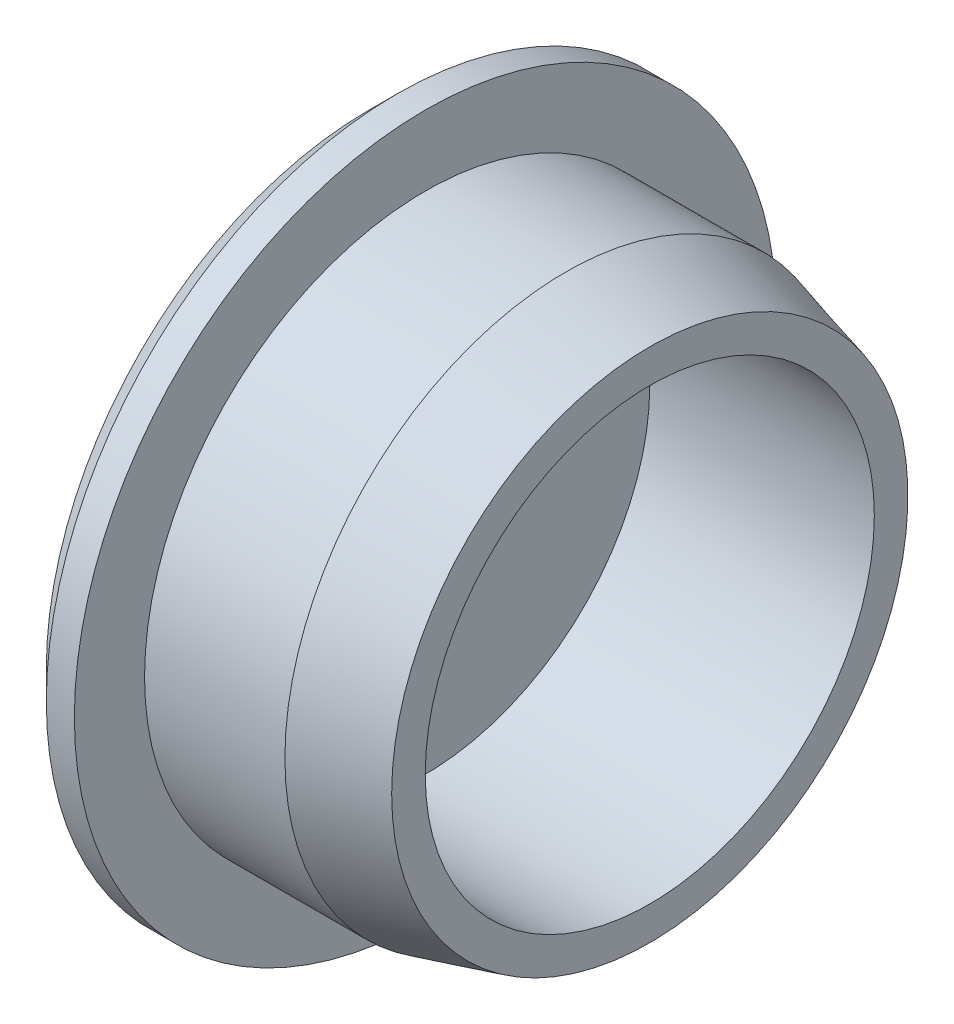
ISO-10303-21;
HEADER;
FILE_DESCRIPTION(('STEP AP214'),'2;1');
FILE_NAME('part.step','',(''),(''),'','','');
FILE_SCHEMA(('AUTOMOTIVE_DESIGN { 1 0 10303 214 1 1 1 1 }'));
ENDSEC;
DATA;
#1=APPLICATION_CONTEXT('core data for automotive mechanical design processes');
#2=APPLICATION_PROTOCOL_DEFINITION('international standard','automotive_design',2000,#1);
#3=PRODUCT_CONTEXT('',#1,'mechanical');
#4=PRODUCT('Part','Part','',(#3));
#5=PRODUCT_RELATED_PRODUCT_CATEGORY('part','',(#4));
#6=PRODUCT_DEFINITION_FORMATION('','',#4);
#7=PRODUCT_DEFINITION_CONTEXT('part definition',#1,'design');
#8=PRODUCT_DEFINITION('design','',#6,#7);
#9=PRODUCT_DEFINITION_SHAPE('','',#8);
#10=(LENGTH_UNIT() NAMED_UNIT(*) SI_UNIT(.MILLI.,.METRE.));
#11=(NAMED_UNIT(*) PLANE_ANGLE_UNIT() SI_UNIT($,.RADIAN.));
#12=(NAMED_UNIT(*) SI_UNIT($,.STERADIAN.) SOLID_ANGLE_UNIT());
#13=UNCERTAINTY_MEASURE_WITH_UNIT(LENGTH_MEASURE(1.E-05),#10,'distance_accuracy_value','');
#14=(GEOMETRIC_REPRESENTATION_CONTEXT(3) GLOBAL_UNCERTAINTY_ASSIGNED_CONTEXT((#13)) GLOBAL_UNIT_ASSIGNED_CONTEXT((#10,
#11,#12)) REPRESENTATION_CONTEXT('',''));
#15=CARTESIAN_POINT('',(0.,0.,0.));
#16=DIRECTION('',(0.,0.,1.));
#17=DIRECTION('',(1.,0.,0.));
#18=AXIS2_PLACEMENT_3D('',#15,#16,#17);
#19=CARTESIAN_POINT('',(0.,8.00000000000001,0.));
#20=DIRECTION('',(-1.,0.,0.));
#21=DIRECTION('',(0.,0.,1.));
#22=AXIS2_PLACEMENT_3D('',#19,#20,#21);
#23=PLANE('',#22);
#24=CARTESIAN_POINT('',(0.,0.,0.));
#25=DIRECTION('',(-1.,0.,0.));
#26=DIRECTION('',(0.,0.,1.));
#27=AXIS2_PLACEMENT_3D('',#24,#25,#26);
#28=CIRCLE('',#27,9.19615242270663);
#29=CARTESIAN_POINT('',(0.,0.,9.19615242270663));
#30=VERTEX_POINT('',#29);
#31=EDGE_CURVE('E10',#30,#30,#28,.T.);
#32=ORIENTED_EDGE('',*,*,#31,.F.);
#33=EDGE_LOOP('',(#32));
#34=FACE_BOUND('',#33,.T.);
#35=CARTESIAN_POINT('',(0.,0.,0.));
#36=DIRECTION('',(-1.,0.,0.));
#37=DIRECTION('',(0.,0.,1.));
#38=AXIS2_PLACEMENT_3D('',#35,#36,#37);
#39=CIRCLE('',#38,8.00000000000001);
#40=CARTESIAN_POINT('',(0.,0.,8.00000000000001));
#41=VERTEX_POINT('',#40);
#42=EDGE_CURVE('E73',#41,#41,#39,.T.);
#43=ORIENTED_EDGE('',*,*,#42,.T.);
#44=EDGE_LOOP('',(#43));
#45=FACE_BOUND('',#44,.T.);
#46=ADVANCED_FACE('F36',(#34,#45),#23,.F.);
#47=CARTESIAN_POINT('',(0.,0.,0.));
#48=DIRECTION('',(-1.,0.,0.));
#49=DIRECTION('',(0.,0.,1.));
#50=AXIS2_PLACEMENT_3D('',#47,#48,#49);
#51=CONICAL_SURFACE('',#50,9.19615242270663,0.261799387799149);
#52=CARTESIAN_POINT('',(-3.,0.,0.));
#53=DIRECTION('',(-1.,0.,0.));
#54=DIRECTION('',(0.,0.,1.));
#55=AXIS2_PLACEMENT_3D('',#52,#53,#54);
#56=CIRCLE('',#55,10.);
#57=CARTESIAN_POINT('',(-3.,0.,10.));
#58=VERTEX_POINT('',#57);
#59=EDGE_CURVE('E43',#58,#58,#56,.T.);
#60=ORIENTED_EDGE('',*,*,#59,.F.);
#61=EDGE_LOOP('',(#60));
#62=FACE_BOUND('',#61,.T.);
#63=ORIENTED_EDGE('',*,*,#31,.T.);
#64=EDGE_LOOP('',(#63));
#65=FACE_BOUND('',#64,.T.);
#66=ADVANCED_FACE('F97',(#62,#65),#51,.T.);
#67=CARTESIAN_POINT('',(-9.99999999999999,0.,0.));
#68=DIRECTION('',(-1.,0.,0.));
#69=DIRECTION('',(0.,0.,1.));
#70=AXIS2_PLACEMENT_3D('',#67,#68,#69);
#71=CYLINDRICAL_SURFACE('',#70,10.);
#72=CARTESIAN_POINT('',(-8.,0.,0.));
#73=DIRECTION('',(-1.,0.,0.));
#74=DIRECTION('',(0.,0.,1.));
#75=AXIS2_PLACEMENT_3D('',#72,#73,#74);
#76=CIRCLE('',#75,10.);
#77=CARTESIAN_POINT('',(-8.,0.,10.));
#78=VERTEX_POINT('',#77);
#79=EDGE_CURVE('E49',#78,#78,#76,.T.);
#80=ORIENTED_EDGE('',*,*,#79,.F.);
#81=EDGE_LOOP('',(#80));
#82=FACE_BOUND('',#81,.T.);
#83=ORIENTED_EDGE('',*,*,#59,.T.);
#84=EDGE_LOOP('',(#83));
#85=FACE_BOUND('',#84,.T.);
#86=ADVANCED_FACE('F102',(#82,#85),#71,.T.);
#87=CARTESIAN_POINT('',(-8.,10.,0.));
#88=DIRECTION('',(-1.,0.,0.));
#89=DIRECTION('',(0.,0.,1.));
#90=AXIS2_PLACEMENT_3D('',#87,#88,#89);
#91=PLANE('',#90);
#92=CARTESIAN_POINT('',(-8.,0.,0.));
#93=DIRECTION('',(-1.,0.,0.));
#94=DIRECTION('',(0.,0.,1.));
#95=AXIS2_PLACEMENT_3D('',#92,#93,#94);
#96=CIRCLE('',#95,12.5);
#97=CARTESIAN_POINT('',(-8.,0.,12.5));
#98=VERTEX_POINT('',#97);
#99=EDGE_CURVE('E55',#98,#98,#96,.T.);
#100=ORIENTED_EDGE('',*,*,#99,.F.);
#101=EDGE_LOOP('',(#100));
#102=FACE_BOUND('',#101,.T.);
#103=ORIENTED_EDGE('',*,*,#79,.T.);
#104=EDGE_LOOP('',(#103));
#105=FACE_BOUND('',#104,.T.);
#106=ADVANCED_FACE('F107',(#102,#105),#91,.F.);
#107=CARTESIAN_POINT('',(-9.99999999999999,0.,0.));
#108=DIRECTION('',(-1.,0.,0.));
#109=DIRECTION('',(0.,0.,1.));
#110=AXIS2_PLACEMENT_3D('',#107,#108,#109);
#111=CYLINDRICAL_SURFACE('',#110,12.5);
#112=CARTESIAN_POINT('',(-9.,0.,0.));
#113=DIRECTION('',(-1.,0.,0.));
#114=DIRECTION('',(0.,0.,1.));
#115=AXIS2_PLACEMENT_3D('',#112,#113,#114);
#116=CIRCLE('',#115,12.5);
#117=CARTESIAN_POINT('',(-9.,0.,12.5));
#118=VERTEX_POINT('',#117);
#119=EDGE_CURVE('E61',#118,#118,#116,.T.);
#120=ORIENTED_EDGE('',*,*,#119,.F.);
#121=EDGE_LOOP('',(#120));
#122=FACE_BOUND('',#121,.T.);
#123=ORIENTED_EDGE('',*,*,#99,.T.);
#124=EDGE_LOOP('',(#123));
#125=FACE_BOUND('',#124,.T.);
#126=ADVANCED_FACE('F113',(#122,#125),#111,.T.);
#127=CARTESIAN_POINT('',(-9.,0.,0.));
#128=DIRECTION('',(1.,0.,0.));
#129=DIRECTION('',(0.,0.,-1.));
#130=AXIS2_PLACEMENT_3D('',#127,#128,#129);
#131=CONICAL_SURFACE('',#130,12.5,0.785398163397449);
#132=CARTESIAN_POINT('',(-10.,0.,0.));
#133=DIRECTION('',(-1.,0.,0.));
#134=DIRECTION('',(0.,0.,1.));
#135=AXIS2_PLACEMENT_3D('',#132,#133,#134);
#136=CIRCLE('',#135,11.5);
#137=CARTESIAN_POINT('',(-10.,0.,11.5));
#138=VERTEX_POINT('',#137);
#139=EDGE_CURVE('E65',#138,#138,#136,.T.);
#140=ORIENTED_EDGE('',*,*,#139,.F.);
#141=EDGE_LOOP('',(#140));
#142=FACE_BOUND('',#141,.T.);
#143=ORIENTED_EDGE('',*,*,#119,.T.);
#144=EDGE_LOOP('',(#143));
#145=FACE_BOUND('',#144,.T.);
#146=ADVANCED_FACE('F93',(#142,#145),#131,.T.);
#147=CARTESIAN_POINT('',(-10.,11.5,0.));
#148=DIRECTION('',(1.,0.,0.));
#149=DIRECTION('',(0.,0.,-1.));
#150=AXIS2_PLACEMENT_3D('',#147,#148,#149);
#151=PLANE('',#150);
#152=ORIENTED_EDGE('',*,*,#139,.T.);
#153=EDGE_LOOP('',(#152));
#154=FACE_BOUND('',#153,.T.);
#155=ADVANCED_FACE('F88',(#154),#151,.F.);
#156=CARTESIAN_POINT('',(-8.,0.,0.));
#157=DIRECTION('',(-1.,0.,0.));
#158=DIRECTION('',(0.,0.,1.));
#159=AXIS2_PLACEMENT_3D('',#156,#157,#158);
#160=PLANE('',#159);
#161=CARTESIAN_POINT('',(-8.,0.,0.));
#162=DIRECTION('',(-1.,0.,0.));
#163=DIRECTION('',(0.,0.,1.));
#164=AXIS2_PLACEMENT_3D('',#161,#162,#163);
#165=CIRCLE('',#164,8.);
#166=CARTESIAN_POINT('',(-8.,0.,8.));
#167=VERTEX_POINT('',#166);
#168=EDGE_CURVE('E69',#167,#167,#165,.T.);
#169=ORIENTED_EDGE('',*,*,#168,.F.);
#170=EDGE_LOOP('',(#169));
#171=FACE_BOUND('',#170,.T.);
#172=ADVANCED_FACE('F83',(#171),#160,.F.);
#173=CARTESIAN_POINT('',(-9.99999999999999,0.,0.));
#174=DIRECTION('',(-1.,0.,0.));
#175=DIRECTION('',(0.,0.,1.));
#176=AXIS2_PLACEMENT_3D('',#173,#174,#175);
#177=CYLINDRICAL_SURFACE('',#176,8.);
#178=ORIENTED_EDGE('',*,*,#42,.F.);
#179=EDGE_LOOP('',(#178));
#180=FACE_BOUND('',#179,.T.);
#181=ORIENTED_EDGE('',*,*,#168,.T.);
#182=EDGE_LOOP('',(#181));
#183=FACE_BOUND('',#182,.T.);
#184=ADVANCED_FACE('F80',(#180,#183),#177,.F.);
#185=CLOSED_SHELL('',(#46,#66,#86,#106,#126,#146,#155,#172,#184));
#186=MANIFOLD_SOLID_BREP('B2',#185);
#187=ADVANCED_BREP_SHAPE_REPRESENTATION('',(#18,#186),#14);
#188=SHAPE_DEFINITION_REPRESENTATION(#9,#187);
ENDSEC;
END-ISO-10303-21;
